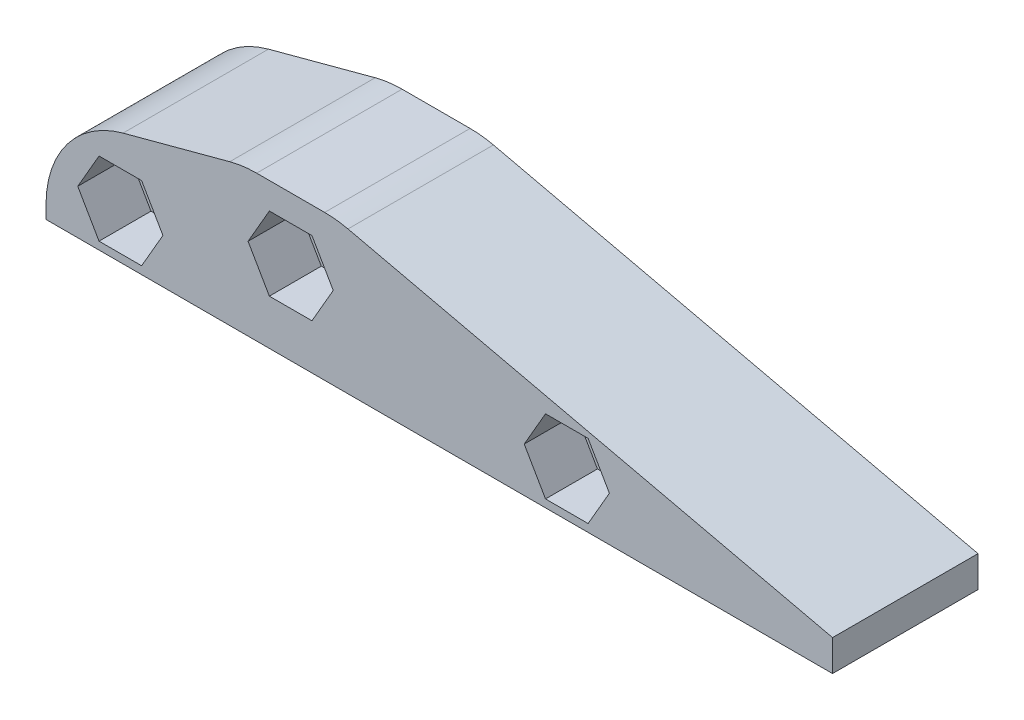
from build123d import *

# Parameters (mm, degrees)
BOSS_EXTRUDE1_DEPTH = 14
FILLET1_R           = 10
FILLET2_R           = 10
CUT_EXTRUDE1_DEPTH  = 5
SKETCH4_R           = 2.05
CUT_EXTRUDE2_DEPTH  = 78.515972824


with BuildPart() as part:
    # Sketch1 → Boss-Extrude1 (new body)
    with BuildSketch(Plane.XY):
        Polygon((0, 0), (0, 8.92), (18.958818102, 14), (27.958818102, 14), (75.708163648, 3), (75.708163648, 0), align=None)
    extrude(amount=BOSS_EXTRUDE1_DEPTH)

    # Fillet1
    fillet1_edges = [part.edges().sort_by_distance(p)[0] for p in [
        (0, 8.92, 7),
    ]]
    fillet(fillet1_edges, radius=FILLET1_R)

    # Fillet2
    fillet2_edges = [part.edges().sort_by_distance(p)[0] for p in [
        (18.958818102, 14, 7),
        (27.958818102, 14, 7),
    ]]
    fillet(fillet2_edges, radius=FILLET2_R)

    # Sketch3 → Cut-Extrude1 (cut)
    with BuildSketch(Plane.XY.offset(14)):
        Polygon((9.204597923, 0.743591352), (11.254191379, 4.293591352), (9.204597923, 7.843591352), (5.105411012, 7.843591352), (3.055817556, 4.293591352), (5.105411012, 0.743591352), align=None)
        Polygon((25.598194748, 4.356888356), (27.647788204, 7.906888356), (25.598194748, 11.456888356), (21.499007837, 11.456888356), (19.449414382, 7.906888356), (21.499007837, 4.356888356), align=None)
        Polygon((52.17923967, 0.743591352), (54.228833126, 4.293591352), (52.17923967, 7.843591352), (48.080052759, 7.843591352), (46.030459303, 4.293591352), (48.080052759, 0.743591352), align=None)
    extrude(amount=-CUT_EXTRUDE1_DEPTH, mode=Mode.SUBTRACT)

    # Sketch4 → Cut-Extrude2 (cut, through all)
    with BuildSketch(Plane.XY.offset(9)):
        with Locations((7.155004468, 4.293591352)):
            Circle(SKETCH4_R)
        with Locations((23.548601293, 7.906888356)):
            Circle(SKETCH4_R)
        with Locations((50.129646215, 4.293591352)):
            Circle(SKETCH4_R)
    extrude(amount=-CUT_EXTRUDE2_DEPTH, mode=Mode.SUBTRACT)


solid = part.part
